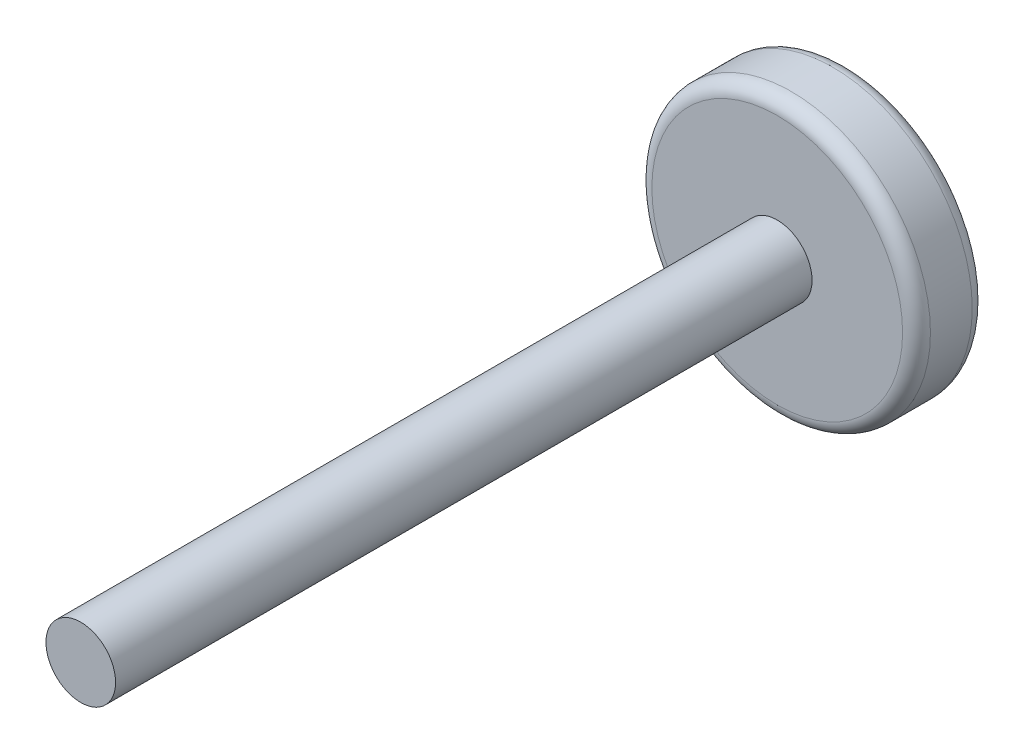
from build123d import *

# Parameters (mm, degrees)
ESQUISSE1_R        = 10
BOSS_EXTRU_1_DEPTH = 5
CONG_1_R           = 1
ESQUISSE2_R        = 2.5
BOSS_EXTRU_2_DEPTH = 50


with BuildPart() as part:
    # Esquisse1 → Boss.-Extru.1 (new body)
    with BuildSketch(Plane.XY):
        Circle(ESQUISSE1_R)
    extrude(amount=BOSS_EXTRU_1_DEPTH)

    # Cong_1
    cong_1_edges = [part.edges().sort_by_distance(p)[0] for p in [
        (-10, 0, 0),
        (-10, 0, 5),
    ]]
    fillet(cong_1_edges, radius=CONG_1_R)

    # Esquisse2 → Boss.-Extru.2 (add)
    with BuildSketch(Plane.XY.offset(5)):
        Circle(ESQUISSE2_R)
    extrude(amount=BOSS_EXTRU_2_DEPTH)


solid = part.part
